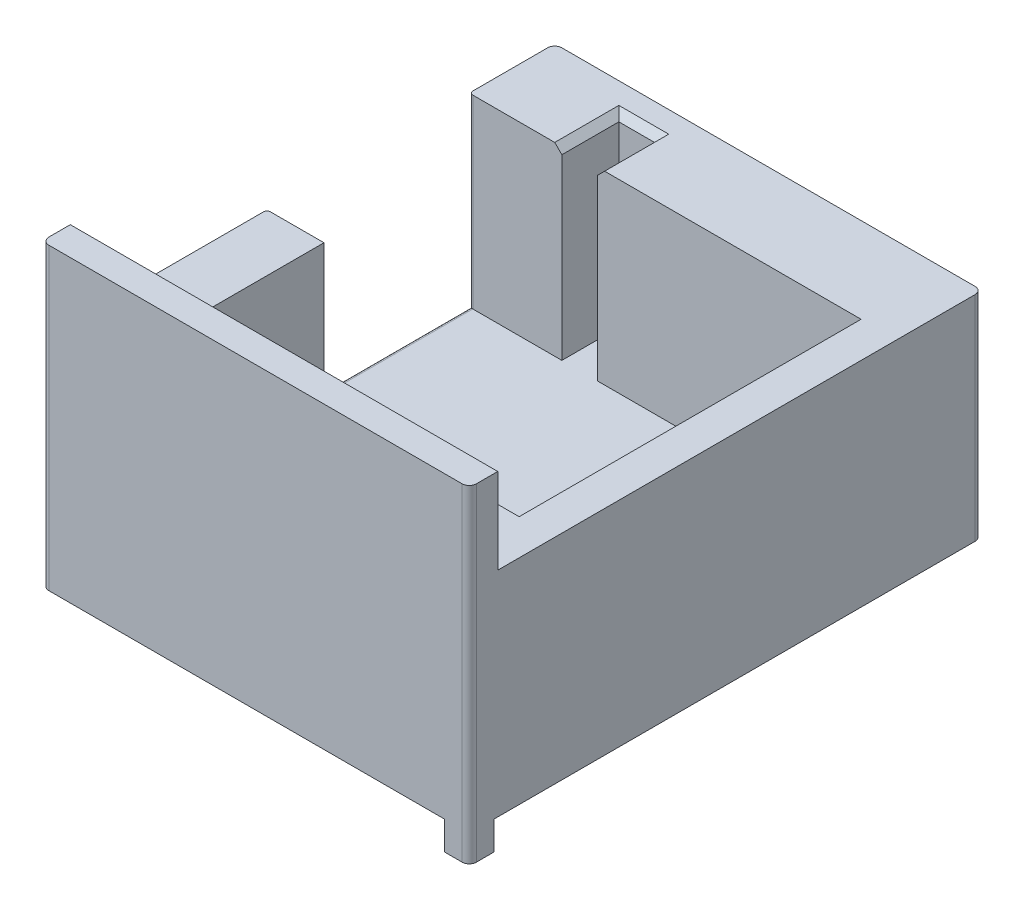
ISO-10303-21;
HEADER;
FILE_DESCRIPTION(('STEP AP214'),'2;1');
FILE_NAME('part.step','',(''),(''),'','','');
FILE_SCHEMA(('AUTOMOTIVE_DESIGN { 1 0 10303 214 1 1 1 1 }'));
ENDSEC;
DATA;
#1=APPLICATION_CONTEXT('core data for automotive mechanical design processes');
#2=APPLICATION_PROTOCOL_DEFINITION('international standard','automotive_design',2000,#1);
#3=PRODUCT_CONTEXT('',#1,'mechanical');
#4=PRODUCT('Part','Part','',(#3));
#5=PRODUCT_RELATED_PRODUCT_CATEGORY('part','',(#4));
#6=PRODUCT_DEFINITION_FORMATION('','',#4);
#7=PRODUCT_DEFINITION_CONTEXT('part definition',#1,'design');
#8=PRODUCT_DEFINITION('design','',#6,#7);
#9=PRODUCT_DEFINITION_SHAPE('','',#8);
#10=(LENGTH_UNIT() NAMED_UNIT(*) SI_UNIT(.MILLI.,.METRE.));
#11=(NAMED_UNIT(*) PLANE_ANGLE_UNIT() SI_UNIT($,.RADIAN.));
#12=(NAMED_UNIT(*) SI_UNIT($,.STERADIAN.) SOLID_ANGLE_UNIT());
#13=UNCERTAINTY_MEASURE_WITH_UNIT(LENGTH_MEASURE(1.E-05),#10,'distance_accuracy_value','');
#14=(GEOMETRIC_REPRESENTATION_CONTEXT(3) GLOBAL_UNCERTAINTY_ASSIGNED_CONTEXT((#13)) GLOBAL_UNIT_ASSIGNED_CONTEXT((#10,
#11,#12)) REPRESENTATION_CONTEXT('',''));
#15=CARTESIAN_POINT('',(0.,0.,0.));
#16=DIRECTION('',(0.,0.,1.));
#17=DIRECTION('',(1.,0.,0.));
#18=AXIS2_PLACEMENT_3D('',#15,#16,#17);
#19=CARTESIAN_POINT('',(0.,15.,0.));
#20=DIRECTION('',(0.,-1.,0.));
#21=DIRECTION('',(0.,0.,-1.));
#22=AXIS2_PLACEMENT_3D('',#19,#20,#21);
#23=PLANE('',#22);
#24=DIRECTION('',(-1.,0.,0.));
#25=VECTOR('',#24,1.);
#26=CARTESIAN_POINT('',(15.001,15.,2.19615242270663));
#27=LINE('',#26,#25);
#28=CARTESIAN_POINT('',(-11.,15.,2.19615242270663));
#29=VERTEX_POINT('',#28);
#30=CARTESIAN_POINT('',(-14.75,15.,2.19615242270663));
#31=VERTEX_POINT('',#30);
#32=EDGE_CURVE('E306',#29,#31,#27,.T.);
#33=ORIENTED_EDGE('',*,*,#32,.T.);
#34=CARTESIAN_POINT('',(-14.75,15.,2.44615242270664));
#35=DIRECTION('',(0.,-1.,0.));
#36=DIRECTION('',(0.,0.,-1.));
#37=AXIS2_PLACEMENT_3D('',#34,#35,#36);
#38=CIRCLE('',#37,0.25);
#39=CARTESIAN_POINT('',(-15.,15.,2.44615242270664));
#40=VERTEX_POINT('',#39);
#41=EDGE_CURVE('E834',#31,#40,#38,.F.);
#42=ORIENTED_EDGE('',*,*,#41,.T.);
#43=DIRECTION('',(0.,0.,1.));
#44=VECTOR('',#43,1.);
#45=CARTESIAN_POINT('',(-15.,15.,18.));
#46=LINE('',#45,#44);
#47=CARTESIAN_POINT('',(-15.,15.,16.));
#48=VERTEX_POINT('',#47);
#49=EDGE_CURVE('E527',#40,#48,#46,.T.);
#50=ORIENTED_EDGE('',*,*,#49,.T.);
#51=DIRECTION('',(1.,0.,0.));
#52=VECTOR('',#51,1.);
#53=CARTESIAN_POINT('',(-21.3245553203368,15.,16.));
#54=LINE('',#53,#52);
#55=CARTESIAN_POINT('',(-9.,15.,16.));
#56=VERTEX_POINT('',#55);
#57=EDGE_CURVE('E436',#48,#56,#54,.T.);
#58=ORIENTED_EDGE('',*,*,#57,.T.);
#59=DIRECTION('',(0.,0.,-1.));
#60=VECTOR('',#59,1.);
#61=CARTESIAN_POINT('',(-9.,15.,0.));
#62=LINE('',#61,#60);
#63=CARTESIAN_POINT('',(-9.,15.,12.));
#64=VERTEX_POINT('',#63);
#65=EDGE_CURVE('E676',#56,#64,#62,.T.);
#66=ORIENTED_EDGE('',*,*,#65,.T.);
#67=DIRECTION('',(1.,0.,0.));
#68=VECTOR('',#67,1.);
#69=CARTESIAN_POINT('',(-8.5,15.,12.));
#70=LINE('',#69,#68);
#71=CARTESIAN_POINT('',(-11.,15.,12.));
#72=VERTEX_POINT('',#71);
#73=EDGE_CURVE('E358',#72,#64,#70,.T.);
#74=ORIENTED_EDGE('',*,*,#73,.F.);
#75=DIRECTION('',(0.,0.,1.));
#76=VECTOR('',#75,1.);
#77=CARTESIAN_POINT('',(-11.,15.,12.));
#78=LINE('',#77,#76);
#79=EDGE_CURVE('E356',#29,#72,#78,.T.);
#80=ORIENTED_EDGE('',*,*,#79,.F.);
#81=EDGE_LOOP('',(#33,#42,#50,#58,#66,#74,#80));
#82=FACE_BOUND('',#81,.T.);
#83=ADVANCED_FACE('F56',(#82),#23,.F.);
#84=CARTESIAN_POINT('',(-15.,15.,18.));
#85=DIRECTION('',(1.,0.,0.));
#86=DIRECTION('',(0.,0.,-1.));
#87=AXIS2_PLACEMENT_3D('',#84,#85,#86);
#88=PLANE('',#87);
#89=ORIENTED_EDGE('',*,*,#49,.F.);
#90=DIRECTION('',(0.,-1.,0.));
#91=VECTOR('',#90,1.);
#92=CARTESIAN_POINT('',(-15.,2.,2.44615242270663));
#93=LINE('',#92,#91);
#94=CARTESIAN_POINT('',(-15.,1.75,2.44615242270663));
#95=VERTEX_POINT('',#94);
#96=EDGE_CURVE('E835',#40,#95,#93,.T.);
#97=ORIENTED_EDGE('',*,*,#96,.T.);
#98=DIRECTION('',(0.,0.,1.));
#99=VECTOR('',#98,1.);
#100=CARTESIAN_POINT('',(-15.,1.75,-12.));
#101=LINE('',#100,#99);
#102=CARTESIAN_POINT('',(-15.,1.75,-12.25));
#103=VERTEX_POINT('',#102);
#104=EDGE_CURVE('E522',#95,#103,#101,.F.);
#105=ORIENTED_EDGE('',*,*,#104,.T.);
#106=DIRECTION('',(0.,1.,0.));
#107=VECTOR('',#106,1.);
#108=CARTESIAN_POINT('',(-15.,15.,-12.25));
#109=LINE('',#108,#107);
#110=CARTESIAN_POINT('',(-15.,15.,-12.25));
#111=VERTEX_POINT('',#110);
#112=EDGE_CURVE('E515',#103,#111,#109,.T.);
#113=ORIENTED_EDGE('',*,*,#112,.T.);
#114=CARTESIAN_POINT('',(-15.,15.,-17.5));
#115=VERTEX_POINT('',#114);
#116=EDGE_CURVE('E429',#115,#111,#46,.T.);
#117=ORIENTED_EDGE('',*,*,#116,.F.);
#118=DIRECTION('',(0.,-1.,0.));
#119=VECTOR('',#118,1.);
#120=CARTESIAN_POINT('',(-15.,15.,-17.5));
#121=LINE('',#120,#119);
#122=CARTESIAN_POINT('',(-15.,0.,-17.5));
#123=VERTEX_POINT('',#122);
#124=EDGE_CURVE('E555',#115,#123,#121,.T.);
#125=ORIENTED_EDGE('',*,*,#124,.T.);
#126=DIRECTION('',(0.,0.,1.));
#127=VECTOR('',#126,1.);
#128=CARTESIAN_POINT('',(-15.,0.,18.));
#129=LINE('',#128,#127);
#130=CARTESIAN_POINT('',(-15.,0.,17.5));
#131=VERTEX_POINT('',#130);
#132=EDGE_CURVE('E538',#123,#131,#129,.T.);
#133=ORIENTED_EDGE('',*,*,#132,.T.);
#134=DIRECTION('',(0.,-1.,0.));
#135=VECTOR('',#134,1.);
#136=CARTESIAN_POINT('',(-15.,15.,17.5));
#137=LINE('',#136,#135);
#138=CARTESIAN_POINT('',(-15.,21.,17.5));
#139=VERTEX_POINT('',#138);
#140=EDGE_CURVE('E558',#131,#139,#137,.F.);
#141=ORIENTED_EDGE('',*,*,#140,.T.);
#142=DIRECTION('',(0.,0.,-1.));
#143=VECTOR('',#142,1.);
#144=CARTESIAN_POINT('',(-15.,21.,18.));
#145=LINE('',#144,#143);
#146=CARTESIAN_POINT('',(-15.,21.,16.));
#147=VERTEX_POINT('',#146);
#148=EDGE_CURVE('E418',#139,#147,#145,.T.);
#149=ORIENTED_EDGE('',*,*,#148,.T.);
#150=DIRECTION('',(0.,-1.,0.));
#151=VECTOR('',#150,1.);
#152=CARTESIAN_POINT('',(-15.,15.,16.));
#153=LINE('',#152,#151);
#154=EDGE_CURVE('E415',#147,#48,#153,.T.);
#155=ORIENTED_EDGE('',*,*,#154,.T.);
#156=EDGE_LOOP('',(#89,#97,#105,#113,#117,#125,#133,#141,#149,#155));
#157=FACE_BOUND('',#156,.T.);
#158=ADVANCED_FACE('F736',(#157),#88,.F.);
#159=ORIENTED_EDGE('',*,*,#116,.T.);
#160=CARTESIAN_POINT('',(-14.75,15.,-12.25));
#161=DIRECTION('',(0.,-1.,0.));
#162=DIRECTION('',(0.,0.,-1.));
#163=AXIS2_PLACEMENT_3D('',#160,#161,#162);
#164=CIRCLE('',#163,0.25);
#165=CARTESIAN_POINT('',(-14.75,15.,-12.));
#166=VERTEX_POINT('',#165);
#167=EDGE_CURVE('E65',#111,#166,#164,.F.);
#168=ORIENTED_EDGE('',*,*,#167,.T.);
#169=DIRECTION('',(-1.,0.,0.));
#170=VECTOR('',#169,1.);
#171=CARTESIAN_POINT('',(-8.5,15.,-12.));
#172=LINE('',#171,#170);
#173=CARTESIAN_POINT('',(-9.,15.,-12.));
#174=VERTEX_POINT('',#173);
#175=EDGE_CURVE('E354',#174,#166,#172,.T.);
#176=ORIENTED_EDGE('',*,*,#175,.F.);
#177=DIRECTION('',(0.,0.,-1.));
#178=VECTOR('',#177,1.);
#179=CARTESIAN_POINT('',(-9.,15.,0.));
#180=LINE('',#179,#178);
#181=CARTESIAN_POINT('',(-9.,15.,-16.5));
#182=VERTEX_POINT('',#181);
#183=EDGE_CURVE('E690',#174,#182,#180,.T.);
#184=ORIENTED_EDGE('',*,*,#183,.T.);
#185=DIRECTION('',(1.,0.,0.));
#186=VECTOR('',#185,1.);
#187=CARTESIAN_POINT('',(0.,15.,-16.5));
#188=LINE('',#187,#186);
#189=CARTESIAN_POINT('',(-5.5,15.,-16.5));
#190=VERTEX_POINT('',#189);
#191=EDGE_CURVE('E691',#182,#190,#188,.T.);
#192=ORIENTED_EDGE('',*,*,#191,.T.);
#193=DIRECTION('',(0.,0.,1.));
#194=VECTOR('',#193,1.);
#195=CARTESIAN_POINT('',(-5.5,15.,0.));
#196=LINE('',#195,#194);
#197=CARTESIAN_POINT('',(-5.49999999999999,15.,-12.));
#198=VERTEX_POINT('',#197);
#199=EDGE_CURVE('E688',#190,#198,#196,.T.);
#200=ORIENTED_EDGE('',*,*,#199,.T.);
#201=DIRECTION('',(-1.,0.,0.));
#202=VECTOR('',#201,1.);
#203=CARTESIAN_POINT('',(12.5,15.,-12.));
#204=LINE('',#203,#202);
#205=CARTESIAN_POINT('',(12.5,15.,-12.));
#206=VERTEX_POINT('',#205);
#207=EDGE_CURVE('E351',#206,#198,#204,.T.);
#208=ORIENTED_EDGE('',*,*,#207,.F.);
#209=DIRECTION('',(0.,0.,-1.));
#210=VECTOR('',#209,1.);
#211=CARTESIAN_POINT('',(12.5,15.,-12.));
#212=LINE('',#211,#210);
#213=CARTESIAN_POINT('',(12.5,15.,12.));
#214=VERTEX_POINT('',#213);
#215=EDGE_CURVE('E348',#214,#206,#212,.T.);
#216=ORIENTED_EDGE('',*,*,#215,.F.);
#217=DIRECTION('',(1.,0.,0.));
#218=VECTOR('',#217,1.);
#219=CARTESIAN_POINT('',(12.5,15.,12.));
#220=LINE('',#219,#218);
#221=CARTESIAN_POINT('',(-5.5,15.,12.));
#222=VERTEX_POINT('',#221);
#223=EDGE_CURVE('E346',#222,#214,#220,.T.);
#224=ORIENTED_EDGE('',*,*,#223,.F.);
#225=DIRECTION('',(0.,0.,1.));
#226=VECTOR('',#225,1.);
#227=CARTESIAN_POINT('',(-5.49999999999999,15.,0.));
#228=LINE('',#227,#226);
#229=CARTESIAN_POINT('',(-5.5,15.,16.));
#230=VERTEX_POINT('',#229);
#231=EDGE_CURVE('E425',#222,#230,#228,.T.);
#232=ORIENTED_EDGE('',*,*,#231,.T.);
#233=CARTESIAN_POINT('',(15.,15.,16.));
#234=VERTEX_POINT('',#233);
#235=EDGE_CURVE('E426',#230,#234,#54,.T.);
#236=ORIENTED_EDGE('',*,*,#235,.T.);
#237=DIRECTION('',(0.,0.,-1.));
#238=VECTOR('',#237,1.);
#239=CARTESIAN_POINT('',(15.,15.,18.));
#240=LINE('',#239,#238);
#241=CARTESIAN_POINT('',(15.,15.,-17.5));
#242=VERTEX_POINT('',#241);
#243=EDGE_CURVE('E393',#234,#242,#240,.T.);
#244=ORIENTED_EDGE('',*,*,#243,.T.);
#245=CARTESIAN_POINT('',(14.5,15.,-17.5));
#246=DIRECTION('',(0.,-1.,0.));
#247=DIRECTION('',(0.,0.,-1.));
#248=AXIS2_PLACEMENT_3D('',#245,#246,#247);
#249=CIRCLE('',#248,0.5);
#250=CARTESIAN_POINT('',(14.5,15.,-18.));
#251=VERTEX_POINT('',#250);
#252=EDGE_CURVE('E576',#242,#251,#249,.F.);
#253=ORIENTED_EDGE('',*,*,#252,.T.);
#254=DIRECTION('',(-1.,0.,0.));
#255=VECTOR('',#254,1.);
#256=CARTESIAN_POINT('',(-15.,15.,-18.));
#257=LINE('',#256,#255);
#258=CARTESIAN_POINT('',(-14.5,15.,-18.));
#259=VERTEX_POINT('',#258);
#260=EDGE_CURVE('E390',#251,#259,#257,.T.);
#261=ORIENTED_EDGE('',*,*,#260,.T.);
#262=CARTESIAN_POINT('',(-14.5,15.,-17.5));
#263=DIRECTION('',(0.,-1.,0.));
#264=DIRECTION('',(0.,0.,-1.));
#265=AXIS2_PLACEMENT_3D('',#262,#263,#264);
#266=CIRCLE('',#265,0.5);
#267=EDGE_CURVE('E578',#259,#115,#266,.F.);
#268=ORIENTED_EDGE('',*,*,#267,.T.);
#269=EDGE_LOOP('',(#159,#168,#176,#184,#192,#200,#208,#216,#224,#232,#236,#244,#253,#261,#268));
#270=FACE_BOUND('',#269,.T.);
#271=ADVANCED_FACE('F696',(#270),#23,.F.);
#272=CARTESIAN_POINT('',(-11.,2.,12.));
#273=DIRECTION('',(-1.,0.,0.));
#274=DIRECTION('',(0.,0.,1.));
#275=AXIS2_PLACEMENT_3D('',#272,#273,#274);
#276=PLANE('',#275);
#277=DIRECTION('',(0.,0.,1.));
#278=VECTOR('',#277,1.);
#279=CARTESIAN_POINT('',(-11.,2.,12.));
#280=LINE('',#279,#278);
#281=CARTESIAN_POINT('',(-11.,2.,2.19615242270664));
#282=VERTEX_POINT('',#281);
#283=CARTESIAN_POINT('',(-11.,2.,12.));
#284=VERTEX_POINT('',#283);
#285=EDGE_CURVE('E317',#282,#284,#280,.T.);
#286=ORIENTED_EDGE('',*,*,#285,.F.);
#287=DIRECTION('',(0.,1.,0.));
#288=VECTOR('',#287,1.);
#289=CARTESIAN_POINT('',(-11.,0.,2.19615242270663));
#290=LINE('',#289,#288);
#291=EDGE_CURVE('E302',#282,#29,#290,.T.);
#292=ORIENTED_EDGE('',*,*,#291,.T.);
#293=ORIENTED_EDGE('',*,*,#79,.T.);
#294=DIRECTION('',(0.,1.,0.));
#295=VECTOR('',#294,1.);
#296=CARTESIAN_POINT('',(-11.,2.,12.));
#297=LINE('',#296,#295);
#298=EDGE_CURVE('E325',#284,#72,#297,.T.);
#299=ORIENTED_EDGE('',*,*,#298,.F.);
#300=EDGE_LOOP('',(#286,#292,#293,#299));
#301=FACE_BOUND('',#300,.T.);
#302=ADVANCED_FACE('F323',(#301),#276,.F.);
#303=CARTESIAN_POINT('',(15.,15.,18.));
#304=DIRECTION('',(-1.,0.,0.));
#305=DIRECTION('',(0.,0.,1.));
#306=AXIS2_PLACEMENT_3D('',#303,#304,#305);
#307=PLANE('',#306);
#308=DIRECTION('',(0.,0.,1.));
#309=VECTOR('',#308,1.);
#310=CARTESIAN_POINT('',(15.,-2.,18.));
#311=LINE('',#310,#309);
#312=CARTESIAN_POINT('',(15.,-2.,16.25));
#313=VERTEX_POINT('',#312);
#314=CARTESIAN_POINT('',(15.,-2.,17.5));
#315=VERTEX_POINT('',#314);
#316=EDGE_CURVE('E440',#313,#315,#311,.T.);
#317=ORIENTED_EDGE('',*,*,#316,.F.);
#318=DIRECTION('',(0.,1.,0.));
#319=VECTOR('',#318,1.);
#320=CARTESIAN_POINT('',(15.,15.,16.25));
#321=LINE('',#320,#319);
#322=CARTESIAN_POINT('',(15.,0.,16.25));
#323=VERTEX_POINT('',#322);
#324=EDGE_CURVE('E465',#313,#323,#321,.T.);
#325=ORIENTED_EDGE('',*,*,#324,.T.);
#326=DIRECTION('',(0.,0.,-1.));
#327=VECTOR('',#326,1.);
#328=CARTESIAN_POINT('',(15.,0.,18.));
#329=LINE('',#328,#327);
#330=CARTESIAN_POINT('',(15.,0.,-17.5));
#331=VERTEX_POINT('',#330);
#332=EDGE_CURVE('E365',#323,#331,#329,.T.);
#333=ORIENTED_EDGE('',*,*,#332,.T.);
#334=DIRECTION('',(0.,-1.,0.));
#335=VECTOR('',#334,1.);
#336=CARTESIAN_POINT('',(15.,15.,-17.5));
#337=LINE('',#336,#335);
#338=EDGE_CURVE('E564',#331,#242,#337,.F.);
#339=ORIENTED_EDGE('',*,*,#338,.T.);
#340=ORIENTED_EDGE('',*,*,#243,.F.);
#341=DIRECTION('',(0.,1.,0.));
#342=VECTOR('',#341,1.);
#343=CARTESIAN_POINT('',(15.,15.,16.));
#344=LINE('',#343,#342);
#345=CARTESIAN_POINT('',(15.,21.,16.));
#346=VERTEX_POINT('',#345);
#347=EDGE_CURVE('E400',#234,#346,#344,.T.);
#348=ORIENTED_EDGE('',*,*,#347,.T.);
#349=DIRECTION('',(0.,0.,1.));
#350=VECTOR('',#349,1.);
#351=CARTESIAN_POINT('',(15.,21.,18.));
#352=LINE('',#351,#350);
#353=CARTESIAN_POINT('',(15.,21.,17.5));
#354=VERTEX_POINT('',#353);
#355=EDGE_CURVE('E403',#346,#354,#352,.T.);
#356=ORIENTED_EDGE('',*,*,#355,.T.);
#357=DIRECTION('',(0.,-1.,0.));
#358=VECTOR('',#357,1.);
#359=CARTESIAN_POINT('',(15.,15.,17.5));
#360=LINE('',#359,#358);
#361=EDGE_CURVE('E566',#354,#315,#360,.T.);
#362=ORIENTED_EDGE('',*,*,#361,.T.);
#363=EDGE_LOOP('',(#317,#325,#333,#339,#340,#348,#356,#362));
#364=FACE_BOUND('',#363,.T.);
#365=ADVANCED_FACE('F623',(#364),#307,.F.);
#366=CARTESIAN_POINT('',(-15.,15.,-18.));
#367=DIRECTION('',(0.,0.,1.));
#368=DIRECTION('',(1.,0.,0.));
#369=AXIS2_PLACEMENT_3D('',#366,#367,#368);
#370=PLANE('',#369);
#371=DIRECTION('',(-1.,0.,0.));
#372=VECTOR('',#371,1.);
#373=CARTESIAN_POINT('',(-15.,0.,-18.));
#374=LINE('',#373,#372);
#375=CARTESIAN_POINT('',(14.5,0.,-18.));
#376=VERTEX_POINT('',#375);
#377=CARTESIAN_POINT('',(-14.5,0.,-18.));
#378=VERTEX_POINT('',#377);
#379=EDGE_CURVE('E533',#376,#378,#374,.T.);
#380=ORIENTED_EDGE('',*,*,#379,.T.);
#381=DIRECTION('',(0.,-1.,0.));
#382=VECTOR('',#381,1.);
#383=CARTESIAN_POINT('',(-14.5,15.,-18.));
#384=LINE('',#383,#382);
#385=EDGE_CURVE('E574',#378,#259,#384,.F.);
#386=ORIENTED_EDGE('',*,*,#385,.T.);
#387=ORIENTED_EDGE('',*,*,#260,.F.);
#388=DIRECTION('',(0.,-1.,0.));
#389=VECTOR('',#388,1.);
#390=CARTESIAN_POINT('',(14.5,15.,-18.));
#391=LINE('',#390,#389);
#392=EDGE_CURVE('E571',#251,#376,#391,.T.);
#393=ORIENTED_EDGE('',*,*,#392,.T.);
#394=EDGE_LOOP('',(#380,#386,#387,#393));
#395=FACE_BOUND('',#394,.T.);
#396=ADVANCED_FACE('F753',(#395),#370,.F.);
#397=CARTESIAN_POINT('',(-15.,15.,18.));
#398=DIRECTION('',(0.,0.,-1.));
#399=DIRECTION('',(-1.,0.,0.));
#400=AXIS2_PLACEMENT_3D('',#397,#398,#399);
#401=PLANE('',#400);
#402=DIRECTION('',(1.,0.,0.));
#403=VECTOR('',#402,1.);
#404=CARTESIAN_POINT('',(-15.,0.,18.));
#405=LINE('',#404,#403);
#406=CARTESIAN_POINT('',(-14.5,0.,18.));
#407=VERTEX_POINT('',#406);
#408=CARTESIAN_POINT('',(13.25,0.,18.));
#409=VERTEX_POINT('',#408);
#410=EDGE_CURVE('E397',#407,#409,#405,.T.);
#411=ORIENTED_EDGE('',*,*,#410,.T.);
#412=DIRECTION('',(0.,-1.,0.));
#413=VECTOR('',#412,1.);
#414=CARTESIAN_POINT('',(13.25,15.,18.));
#415=LINE('',#414,#413);
#416=CARTESIAN_POINT('',(13.25,-2.,18.));
#417=VERTEX_POINT('',#416);
#418=EDGE_CURVE('E587',#409,#417,#415,.T.);
#419=ORIENTED_EDGE('',*,*,#418,.T.);
#420=DIRECTION('',(-1.,0.,0.));
#421=VECTOR('',#420,1.);
#422=CARTESIAN_POINT('',(15.,-2.,18.));
#423=LINE('',#422,#421);
#424=CARTESIAN_POINT('',(14.5,-2.,18.));
#425=VERTEX_POINT('',#424);
#426=EDGE_CURVE('E442',#425,#417,#423,.T.);
#427=ORIENTED_EDGE('',*,*,#426,.F.);
#428=DIRECTION('',(0.,-1.,0.));
#429=VECTOR('',#428,1.);
#430=CARTESIAN_POINT('',(14.5,15.,18.));
#431=LINE('',#430,#429);
#432=CARTESIAN_POINT('',(14.5,21.,18.));
#433=VERTEX_POINT('',#432);
#434=EDGE_CURVE('E543',#425,#433,#431,.F.);
#435=ORIENTED_EDGE('',*,*,#434,.T.);
#436=DIRECTION('',(1.,0.,0.));
#437=VECTOR('',#436,1.);
#438=CARTESIAN_POINT('',(-21.3245553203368,21.,18.));
#439=LINE('',#438,#437);
#440=CARTESIAN_POINT('',(-14.5,21.,18.));
#441=VERTEX_POINT('',#440);
#442=EDGE_CURVE('E419',#441,#433,#439,.T.);
#443=ORIENTED_EDGE('',*,*,#442,.F.);
#444=DIRECTION('',(0.,-1.,0.));
#445=VECTOR('',#444,1.);
#446=CARTESIAN_POINT('',(-14.5,15.,18.));
#447=LINE('',#446,#445);
#448=EDGE_CURVE('E545',#441,#407,#447,.T.);
#449=ORIENTED_EDGE('',*,*,#448,.T.);
#450=EDGE_LOOP('',(#411,#419,#427,#435,#443,#449));
#451=FACE_BOUND('',#450,.T.);
#452=ADVANCED_FACE('F635',(#451),#401,.F.);
#453=CARTESIAN_POINT('',(0.,0.,0.));
#454=DIRECTION('',(0.,-1.,0.));
#455=DIRECTION('',(0.,0.,-1.));
#456=AXIS2_PLACEMENT_3D('',#453,#454,#455);
#457=PLANE('',#456);
#458=DIRECTION('',(0.,0.,1.));
#459=VECTOR('',#458,1.);
#460=CARTESIAN_POINT('',(12.5,0.,0.));
#461=LINE('',#460,#459);
#462=CARTESIAN_POINT('',(12.5,0.,-12.));
#463=VERTEX_POINT('',#462);
#464=CARTESIAN_POINT('',(12.5,0.,12.));
#465=VERTEX_POINT('',#464);
#466=EDGE_CURVE('E483',#463,#465,#461,.T.);
#467=ORIENTED_EDGE('',*,*,#466,.F.);
#468=DIRECTION('',(1.,0.,0.));
#469=VECTOR('',#468,1.);
#470=CARTESIAN_POINT('',(0.,0.,-12.));
#471=LINE('',#470,#469);
#472=CARTESIAN_POINT('',(9.49999999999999,0.,-12.));
#473=VERTEX_POINT('',#472);
#474=EDGE_CURVE('E475',#473,#463,#471,.T.);
#475=ORIENTED_EDGE('',*,*,#474,.F.);
#476=DIRECTION('',(0.,0.,-1.));
#477=VECTOR('',#476,1.);
#478=CARTESIAN_POINT('',(9.5,0.,0.));
#479=LINE('',#478,#477);
#480=CARTESIAN_POINT('',(9.5,0.,12.));
#481=VERTEX_POINT('',#480);
#482=EDGE_CURVE('E478',#481,#473,#479,.T.);
#483=ORIENTED_EDGE('',*,*,#482,.F.);
#484=DIRECTION('',(-1.,0.,0.));
#485=VECTOR('',#484,1.);
#486=CARTESIAN_POINT('',(0.,0.,12.));
#487=LINE('',#486,#485);
#488=EDGE_CURVE('E481',#465,#481,#487,.T.);
#489=ORIENTED_EDGE('',*,*,#488,.F.);
#490=EDGE_LOOP('',(#467,#475,#483,#489));
#491=FACE_BOUND('',#490,.T.);
#492=ORIENTED_EDGE('',*,*,#410,.F.);
#493=CARTESIAN_POINT('',(-14.5,0.,17.5));
#494=DIRECTION('',(0.,-1.,0.));
#495=DIRECTION('',(0.,0.,-1.));
#496=AXIS2_PLACEMENT_3D('',#493,#494,#495);
#497=CIRCLE('',#496,0.5);
#498=EDGE_CURVE('E553',#407,#131,#497,.T.);
#499=ORIENTED_EDGE('',*,*,#498,.T.);
#500=ORIENTED_EDGE('',*,*,#132,.F.);
#501=CARTESIAN_POINT('',(-14.5,0.,-17.5));
#502=DIRECTION('',(0.,-1.,0.));
#503=DIRECTION('',(0.,0.,-1.));
#504=AXIS2_PLACEMENT_3D('',#501,#502,#503);
#505=CIRCLE('',#504,0.5);
#506=EDGE_CURVE('E551',#123,#378,#505,.T.);
#507=ORIENTED_EDGE('',*,*,#506,.T.);
#508=ORIENTED_EDGE('',*,*,#379,.F.);
#509=CARTESIAN_POINT('',(14.5,0.,-17.5));
#510=DIRECTION('',(0.,-1.,0.));
#511=DIRECTION('',(0.,0.,-1.));
#512=AXIS2_PLACEMENT_3D('',#509,#510,#511);
#513=CIRCLE('',#512,0.5);
#514=EDGE_CURVE('E549',#376,#331,#513,.T.);
#515=ORIENTED_EDGE('',*,*,#514,.T.);
#516=ORIENTED_EDGE('',*,*,#332,.F.);
#517=DIRECTION('',(0.707106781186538,0.,0.707106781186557));
#518=VECTOR('',#517,1.);
#519=CARTESIAN_POINT('',(15.,0.,16.25));
#520=LINE('',#519,#518);
#521=CARTESIAN_POINT('',(14.75,0.,16.));
#522=VERTEX_POINT('',#521);
#523=EDGE_CURVE('E473',#323,#522,#520,.F.);
#524=ORIENTED_EDGE('',*,*,#523,.T.);
#525=DIRECTION('',(1.,0.,0.));
#526=VECTOR('',#525,1.);
#527=CARTESIAN_POINT('',(15.,0.,16.));
#528=LINE('',#527,#526);
#529=CARTESIAN_POINT('',(13.25,0.,16.));
#530=VERTEX_POINT('',#529);
#531=EDGE_CURVE('E443',#530,#522,#528,.T.);
#532=ORIENTED_EDGE('',*,*,#531,.F.);
#533=DIRECTION('',(0.707106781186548,0.,-0.707106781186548));
#534=VECTOR('',#533,1.);
#535=CARTESIAN_POINT('',(13.25,0.,16.));
#536=LINE('',#535,#534);
#537=CARTESIAN_POINT('',(13.,0.,16.25));
#538=VERTEX_POINT('',#537);
#539=EDGE_CURVE('E471',#530,#538,#536,.F.);
#540=ORIENTED_EDGE('',*,*,#539,.T.);
#541=DIRECTION('',(0.,0.,-1.));
#542=VECTOR('',#541,1.);
#543=CARTESIAN_POINT('',(13.,0.,18.));
#544=LINE('',#543,#542);
#545=CARTESIAN_POINT('',(13.,0.,17.75));
#546=VERTEX_POINT('',#545);
#547=EDGE_CURVE('E457',#546,#538,#544,.T.);
#548=ORIENTED_EDGE('',*,*,#547,.F.);
#549=DIRECTION('',(-0.707106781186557,0.,-0.707106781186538));
#550=VECTOR('',#549,1.);
#551=CARTESIAN_POINT('',(13.,0.,17.75));
#552=LINE('',#551,#550);
#553=EDGE_CURVE('E468',#546,#409,#552,.F.);
#554=ORIENTED_EDGE('',*,*,#553,.T.);
#555=EDGE_LOOP('',(#492,#499,#500,#507,#508,#515,#516,#524,#532,#540,#548,#554));
#556=FACE_BOUND('',#555,.T.);
#557=ADVANCED_FACE('F608',(#491,#556),#457,.T.);
#558=CARTESIAN_POINT('',(12.5,2.,12.));
#559=DIRECTION('',(0.,0.,1.));
#560=DIRECTION('',(1.,0.,0.));
#561=AXIS2_PLACEMENT_3D('',#558,#559,#560);
#562=PLANE('',#561);
#563=DIRECTION('',(0.,1.,0.));
#564=VECTOR('',#563,1.);
#565=CARTESIAN_POINT('',(-6.,2.,12.));
#566=LINE('',#565,#564);
#567=CARTESIAN_POINT('',(-6.,2.,12.));
#568=VERTEX_POINT('',#567);
#569=CARTESIAN_POINT('',(-6.,14.5,12.));
#570=VERTEX_POINT('',#569);
#571=EDGE_CURVE('E362',#568,#570,#566,.T.);
#572=ORIENTED_EDGE('',*,*,#571,.T.);
#573=DIRECTION('',(-0.707106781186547,-0.707106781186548,0.));
#574=VECTOR('',#573,1.);
#575=CARTESIAN_POINT('',(-6.,14.5,12.));
#576=LINE('',#575,#574);
#577=EDGE_CURVE('E669',#570,#222,#576,.F.);
#578=ORIENTED_EDGE('',*,*,#577,.T.);
#579=ORIENTED_EDGE('',*,*,#223,.T.);
#580=DIRECTION('',(0.,1.,0.));
#581=VECTOR('',#580,1.);
#582=CARTESIAN_POINT('',(12.5,2.,12.));
#583=LINE('',#582,#581);
#584=EDGE_CURVE('E345',#465,#214,#583,.T.);
#585=ORIENTED_EDGE('',*,*,#584,.F.);
#586=ORIENTED_EDGE('',*,*,#488,.T.);
#587=DIRECTION('',(0.,1.,0.));
#588=VECTOR('',#587,1.);
#589=CARTESIAN_POINT('',(9.5,-8.,12.));
#590=LINE('',#589,#588);
#591=CARTESIAN_POINT('',(9.5,2.,12.));
#592=VERTEX_POINT('',#591);
#593=EDGE_CURVE('E650',#481,#592,#590,.T.);
#594=ORIENTED_EDGE('',*,*,#593,.T.);
#595=DIRECTION('',(1.,0.,0.));
#596=VECTOR('',#595,1.);
#597=CARTESIAN_POINT('',(12.5,2.,12.));
#598=LINE('',#597,#596);
#599=EDGE_CURVE('E361',#568,#592,#598,.T.);
#600=ORIENTED_EDGE('',*,*,#599,.F.);
#601=EDGE_LOOP('',(#572,#578,#579,#585,#586,#594,#600));
#602=FACE_BOUND('',#601,.T.);
#603=ADVANCED_FACE('F709',(#602),#562,.F.);
#604=CARTESIAN_POINT('',(-6.,2.,12.));
#605=DIRECTION('',(1.,0.,0.));
#606=DIRECTION('',(0.,0.,-1.));
#607=AXIS2_PLACEMENT_3D('',#604,#605,#606);
#608=PLANE('',#607);
#609=DIRECTION('',(0.,1.,0.));
#610=VECTOR('',#609,1.);
#611=CARTESIAN_POINT('',(-6.,2.,16.));
#612=LINE('',#611,#610);
#613=CARTESIAN_POINT('',(-6.,2.,16.));
#614=VERTEX_POINT('',#613);
#615=CARTESIAN_POINT('',(-6.,14.5,16.));
#616=VERTEX_POINT('',#615);
#617=EDGE_CURVE('E366',#614,#616,#612,.T.);
#618=ORIENTED_EDGE('',*,*,#617,.T.);
#619=DIRECTION('',(0.,0.,-1.));
#620=VECTOR('',#619,1.);
#621=CARTESIAN_POINT('',(-6.,14.5,12.));
#622=LINE('',#621,#620);
#623=EDGE_CURVE('E671',#616,#570,#622,.T.);
#624=ORIENTED_EDGE('',*,*,#623,.T.);
#625=ORIENTED_EDGE('',*,*,#571,.F.);
#626=DIRECTION('',(0.,0.,-1.));
#627=VECTOR('',#626,1.);
#628=CARTESIAN_POINT('',(-6.,2.,12.));
#629=LINE('',#628,#627);
#630=EDGE_CURVE('E342',#614,#568,#629,.T.);
#631=ORIENTED_EDGE('',*,*,#630,.F.);
#632=EDGE_LOOP('',(#618,#624,#625,#631));
#633=FACE_BOUND('',#632,.T.);
#634=ADVANCED_FACE('F707',(#633),#608,.F.);
#635=CARTESIAN_POINT('',(-6.,2.,16.));
#636=DIRECTION('',(0.,0.,1.));
#637=DIRECTION('',(1.,0.,0.));
#638=AXIS2_PLACEMENT_3D('',#635,#636,#637);
#639=PLANE('',#638);
#640=DIRECTION('',(0.,1.,0.));
#641=VECTOR('',#640,1.);
#642=CARTESIAN_POINT('',(-8.5,2.,16.));
#643=LINE('',#642,#641);
#644=CARTESIAN_POINT('',(-8.5,2.,16.));
#645=VERTEX_POINT('',#644);
#646=CARTESIAN_POINT('',(-8.5,14.5,16.));
#647=VERTEX_POINT('',#646);
#648=EDGE_CURVE('E370',#645,#647,#643,.T.);
#649=ORIENTED_EDGE('',*,*,#648,.T.);
#650=DIRECTION('',(0.707106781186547,-0.707106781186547,0.));
#651=VECTOR('',#650,1.);
#652=CARTESIAN_POINT('',(-1.,7.,16.));
#653=LINE('',#652,#651);
#654=EDGE_CURVE('E667',#647,#56,#653,.F.);
#655=ORIENTED_EDGE('',*,*,#654,.T.);
#656=ORIENTED_EDGE('',*,*,#57,.F.);
#657=ORIENTED_EDGE('',*,*,#154,.F.);
#658=DIRECTION('',(1.,0.,0.));
#659=VECTOR('',#658,1.);
#660=CARTESIAN_POINT('',(-21.3245553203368,21.,16.));
#661=LINE('',#660,#659);
#662=EDGE_CURVE('E434',#147,#346,#661,.T.);
#663=ORIENTED_EDGE('',*,*,#662,.T.);
#664=ORIENTED_EDGE('',*,*,#347,.F.);
#665=ORIENTED_EDGE('',*,*,#235,.F.);
#666=DIRECTION('',(0.707106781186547,0.707106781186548,0.));
#667=VECTOR('',#666,1.);
#668=CARTESIAN_POINT('',(-12.25,8.24999999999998,16.));
#669=LINE('',#668,#667);
#670=EDGE_CURVE('E546',#230,#616,#669,.F.);
#671=ORIENTED_EDGE('',*,*,#670,.T.);
#672=ORIENTED_EDGE('',*,*,#617,.F.);
#673=DIRECTION('',(1.,0.,0.));
#674=VECTOR('',#673,1.);
#675=CARTESIAN_POINT('',(-6.,2.,16.));
#676=LINE('',#675,#674);
#677=EDGE_CURVE('E339',#645,#614,#676,.T.);
#678=ORIENTED_EDGE('',*,*,#677,.F.);
#679=EDGE_LOOP('',(#649,#655,#656,#657,#663,#664,#665,#671,#672,#678));
#680=FACE_BOUND('',#679,.T.);
#681=ADVANCED_FACE('F702',(#680),#639,.F.);
#682=CARTESIAN_POINT('',(-8.5,2.,16.));
#683=DIRECTION('',(-1.,0.,0.));
#684=DIRECTION('',(0.,0.,1.));
#685=AXIS2_PLACEMENT_3D('',#682,#683,#684);
#686=PLANE('',#685);
#687=DIRECTION('',(0.,1.,0.));
#688=VECTOR('',#687,1.);
#689=CARTESIAN_POINT('',(-8.5,2.,12.));
#690=LINE('',#689,#688);
#691=CARTESIAN_POINT('',(-8.5,2.,12.));
#692=VERTEX_POINT('',#691);
#693=CARTESIAN_POINT('',(-8.5,14.5,12.));
#694=VERTEX_POINT('',#693);
#695=EDGE_CURVE('E367',#692,#694,#690,.T.);
#696=ORIENTED_EDGE('',*,*,#695,.T.);
#697=DIRECTION('',(0.,0.,1.));
#698=VECTOR('',#697,1.);
#699=CARTESIAN_POINT('',(-8.5,14.5,16.));
#700=LINE('',#699,#698);
#701=EDGE_CURVE('E678',#694,#647,#700,.T.);
#702=ORIENTED_EDGE('',*,*,#701,.T.);
#703=ORIENTED_EDGE('',*,*,#648,.F.);
#704=DIRECTION('',(0.,0.,1.));
#705=VECTOR('',#704,1.);
#706=CARTESIAN_POINT('',(-8.5,2.,16.));
#707=LINE('',#706,#705);
#708=EDGE_CURVE('E330',#692,#645,#707,.T.);
#709=ORIENTED_EDGE('',*,*,#708,.F.);
#710=EDGE_LOOP('',(#696,#702,#703,#709));
#711=FACE_BOUND('',#710,.T.);
#712=ADVANCED_FACE('F715',(#711),#686,.F.);
#713=CARTESIAN_POINT('',(-8.5,2.,12.));
#714=DIRECTION('',(0.,0.,1.));
#715=DIRECTION('',(1.,0.,0.));
#716=AXIS2_PLACEMENT_3D('',#713,#714,#715);
#717=PLANE('',#716);
#718=ORIENTED_EDGE('',*,*,#73,.T.);
#719=DIRECTION('',(-0.707106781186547,0.707106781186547,0.));
#720=VECTOR('',#719,1.);
#721=CARTESIAN_POINT('',(-8.5,14.5,12.));
#722=LINE('',#721,#720);
#723=EDGE_CURVE('E674',#64,#694,#722,.F.);
#724=ORIENTED_EDGE('',*,*,#723,.T.);
#725=ORIENTED_EDGE('',*,*,#695,.F.);
#726=DIRECTION('',(1.,0.,0.));
#727=VECTOR('',#726,1.);
#728=CARTESIAN_POINT('',(-8.5,2.,12.));
#729=LINE('',#728,#727);
#730=EDGE_CURVE('E327',#284,#692,#729,.T.);
#731=ORIENTED_EDGE('',*,*,#730,.F.);
#732=ORIENTED_EDGE('',*,*,#298,.T.);
#733=EDGE_LOOP('',(#718,#724,#725,#731,#732));
#734=FACE_BOUND('',#733,.T.);
#735=ADVANCED_FACE('F724',(#734),#717,.F.);
#736=CARTESIAN_POINT('',(-8.5,2.,-12.));
#737=DIRECTION('',(0.,0.,-1.));
#738=DIRECTION('',(-1.,0.,0.));
#739=AXIS2_PLACEMENT_3D('',#736,#737,#738);
#740=PLANE('',#739);
#741=ORIENTED_EDGE('',*,*,#175,.T.);
#742=DIRECTION('',(0.,1.,0.));
#743=VECTOR('',#742,1.);
#744=CARTESIAN_POINT('',(-14.75,2.,-12.));
#745=LINE('',#744,#743);
#746=CARTESIAN_POINT('',(-14.75,2.,-12.));
#747=VERTEX_POINT('',#746);
#748=EDGE_CURVE('E12',#166,#747,#745,.F.);
#749=ORIENTED_EDGE('',*,*,#748,.T.);
#750=DIRECTION('',(-1.,0.,0.));
#751=VECTOR('',#750,1.);
#752=CARTESIAN_POINT('',(-8.5,2.,-12.));
#753=LINE('',#752,#751);
#754=CARTESIAN_POINT('',(-8.5,2.,-12.));
#755=VERTEX_POINT('',#754);
#756=EDGE_CURVE('E328',#755,#747,#753,.T.);
#757=ORIENTED_EDGE('',*,*,#756,.F.);
#758=DIRECTION('',(0.,1.,0.));
#759=VECTOR('',#758,1.);
#760=CARTESIAN_POINT('',(-8.5,2.,-12.));
#761=LINE('',#760,#759);
#762=CARTESIAN_POINT('',(-8.5,14.5,-12.));
#763=VERTEX_POINT('',#762);
#764=EDGE_CURVE('E372',#755,#763,#761,.T.);
#765=ORIENTED_EDGE('',*,*,#764,.T.);
#766=DIRECTION('',(0.707106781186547,-0.707106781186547,0.));
#767=VECTOR('',#766,1.);
#768=CARTESIAN_POINT('',(-8.5,14.5,-12.));
#769=LINE('',#768,#767);
#770=EDGE_CURVE('E683',#763,#174,#769,.F.);
#771=ORIENTED_EDGE('',*,*,#770,.T.);
#772=EDGE_LOOP('',(#741,#749,#757,#765,#771));
#773=FACE_BOUND('',#772,.T.);
#774=ADVANCED_FACE('F510',(#773),#740,.F.);
#775=CARTESIAN_POINT('',(-8.5,2.,-16.));
#776=DIRECTION('',(-1.,0.,0.));
#777=DIRECTION('',(0.,0.,1.));
#778=AXIS2_PLACEMENT_3D('',#775,#776,#777);
#779=PLANE('',#778);
#780=DIRECTION('',(0.,1.,0.));
#781=VECTOR('',#780,1.);
#782=CARTESIAN_POINT('',(-8.5,2.,-16.));
#783=LINE('',#782,#781);
#784=CARTESIAN_POINT('',(-8.5,2.,-16.));
#785=VERTEX_POINT('',#784);
#786=CARTESIAN_POINT('',(-8.5,14.5,-16.));
#787=VERTEX_POINT('',#786);
#788=EDGE_CURVE('E375',#785,#787,#783,.T.);
#789=ORIENTED_EDGE('',*,*,#788,.T.);
#790=DIRECTION('',(0.,0.,1.));
#791=VECTOR('',#790,1.);
#792=CARTESIAN_POINT('',(-8.5,14.5,-16.));
#793=LINE('',#792,#791);
#794=EDGE_CURVE('E507',#787,#763,#793,.T.);
#795=ORIENTED_EDGE('',*,*,#794,.T.);
#796=ORIENTED_EDGE('',*,*,#764,.F.);
#797=DIRECTION('',(0.,0.,1.));
#798=VECTOR('',#797,1.);
#799=CARTESIAN_POINT('',(-8.5,2.,-16.));
#800=LINE('',#799,#798);
#801=EDGE_CURVE('E332',#785,#755,#800,.T.);
#802=ORIENTED_EDGE('',*,*,#801,.F.);
#803=EDGE_LOOP('',(#789,#795,#796,#802));
#804=FACE_BOUND('',#803,.T.);
#805=ADVANCED_FACE('F505',(#804),#779,.F.);
#806=CARTESIAN_POINT('',(-6.,2.,-16.));
#807=DIRECTION('',(0.,0.,-1.));
#808=DIRECTION('',(-1.,0.,0.));
#809=AXIS2_PLACEMENT_3D('',#806,#807,#808);
#810=PLANE('',#809);
#811=DIRECTION('',(0.,1.,0.));
#812=VECTOR('',#811,1.);
#813=CARTESIAN_POINT('',(-6.,2.,-16.));
#814=LINE('',#813,#812);
#815=CARTESIAN_POINT('',(-6.,2.,-16.));
#816=VERTEX_POINT('',#815);
#817=CARTESIAN_POINT('',(-6.,14.5,-16.));
#818=VERTEX_POINT('',#817);
#819=EDGE_CURVE('E378',#816,#818,#814,.T.);
#820=ORIENTED_EDGE('',*,*,#819,.T.);
#821=DIRECTION('',(-1.,0.,0.));
#822=VECTOR('',#821,1.);
#823=CARTESIAN_POINT('',(-6.,14.5,-16.));
#824=LINE('',#823,#822);
#825=EDGE_CURVE('E681',#818,#787,#824,.T.);
#826=ORIENTED_EDGE('',*,*,#825,.T.);
#827=ORIENTED_EDGE('',*,*,#788,.F.);
#828=DIRECTION('',(-1.,0.,0.));
#829=VECTOR('',#828,1.);
#830=CARTESIAN_POINT('',(-6.,2.,-16.));
#831=LINE('',#830,#829);
#832=EDGE_CURVE('E497',#816,#785,#831,.T.);
#833=ORIENTED_EDGE('',*,*,#832,.F.);
#834=EDGE_LOOP('',(#820,#826,#827,#833));
#835=FACE_BOUND('',#834,.T.);
#836=ADVANCED_FACE('F757',(#835),#810,.F.);
#837=CARTESIAN_POINT('',(-6.,2.,-12.));
#838=DIRECTION('',(1.,0.,0.));
#839=DIRECTION('',(0.,0.,-1.));
#840=AXIS2_PLACEMENT_3D('',#837,#838,#839);
#841=PLANE('',#840);
#842=DIRECTION('',(0.,1.,0.));
#843=VECTOR('',#842,1.);
#844=CARTESIAN_POINT('',(-6.,2.,-12.));
#845=LINE('',#844,#843);
#846=CARTESIAN_POINT('',(-6.,2.,-12.));
#847=VERTEX_POINT('',#846);
#848=CARTESIAN_POINT('',(-6.,14.5,-12.));
#849=VERTEX_POINT('',#848);
#850=EDGE_CURVE('E381',#847,#849,#845,.T.);
#851=ORIENTED_EDGE('',*,*,#850,.T.);
#852=DIRECTION('',(0.,0.,-1.));
#853=VECTOR('',#852,1.);
#854=CARTESIAN_POINT('',(-6.,14.5,-12.));
#855=LINE('',#854,#853);
#856=EDGE_CURVE('E422',#849,#818,#855,.T.);
#857=ORIENTED_EDGE('',*,*,#856,.T.);
#858=ORIENTED_EDGE('',*,*,#819,.F.);
#859=DIRECTION('',(0.,0.,-1.));
#860=VECTOR('',#859,1.);
#861=CARTESIAN_POINT('',(-6.,2.,-12.));
#862=LINE('',#861,#860);
#863=EDGE_CURVE('E495',#847,#816,#862,.T.);
#864=ORIENTED_EDGE('',*,*,#863,.F.);
#865=EDGE_LOOP('',(#851,#857,#858,#864));
#866=FACE_BOUND('',#865,.T.);
#867=ADVANCED_FACE('F760',(#866),#841,.F.);
#868=CARTESIAN_POINT('',(12.5,2.,-12.));
#869=DIRECTION('',(0.,0.,-1.));
#870=DIRECTION('',(-1.,0.,0.));
#871=AXIS2_PLACEMENT_3D('',#868,#869,#870);
#872=PLANE('',#871);
#873=ORIENTED_EDGE('',*,*,#207,.T.);
#874=DIRECTION('',(0.707106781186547,0.707106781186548,0.));
#875=VECTOR('',#874,1.);
#876=CARTESIAN_POINT('',(-6.,14.5,-12.));
#877=LINE('',#876,#875);
#878=EDGE_CURVE('E686',#198,#849,#877,.F.);
#879=ORIENTED_EDGE('',*,*,#878,.T.);
#880=ORIENTED_EDGE('',*,*,#850,.F.);
#881=DIRECTION('',(-1.,0.,0.));
#882=VECTOR('',#881,1.);
#883=CARTESIAN_POINT('',(12.5,2.,-12.));
#884=LINE('',#883,#882);
#885=CARTESIAN_POINT('',(9.5,2.,-12.));
#886=VERTEX_POINT('',#885);
#887=EDGE_CURVE('E489',#886,#847,#884,.T.);
#888=ORIENTED_EDGE('',*,*,#887,.F.);
#889=DIRECTION('',(0.,1.,0.));
#890=VECTOR('',#889,1.);
#891=CARTESIAN_POINT('',(9.49999999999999,-8.,-12.));
#892=LINE('',#891,#890);
#893=EDGE_CURVE('E648',#473,#886,#892,.T.);
#894=ORIENTED_EDGE('',*,*,#893,.F.);
#895=ORIENTED_EDGE('',*,*,#474,.T.);
#896=DIRECTION('',(0.,1.,0.));
#897=VECTOR('',#896,1.);
#898=CARTESIAN_POINT('',(12.5,2.,-12.));
#899=LINE('',#898,#897);
#900=EDGE_CURVE('E384',#463,#206,#899,.T.);
#901=ORIENTED_EDGE('',*,*,#900,.T.);
#902=EDGE_LOOP('',(#873,#879,#880,#888,#894,#895,#901));
#903=FACE_BOUND('',#902,.T.);
#904=ADVANCED_FACE('F764',(#903),#872,.F.);
#905=CARTESIAN_POINT('',(12.5,2.,-12.));
#906=DIRECTION('',(1.,0.,0.));
#907=DIRECTION('',(0.,0.,-1.));
#908=AXIS2_PLACEMENT_3D('',#905,#906,#907);
#909=PLANE('',#908);
#910=ORIENTED_EDGE('',*,*,#215,.T.);
#911=ORIENTED_EDGE('',*,*,#900,.F.);
#912=ORIENTED_EDGE('',*,*,#466,.T.);
#913=ORIENTED_EDGE('',*,*,#584,.T.);
#914=EDGE_LOOP('',(#910,#911,#912,#913));
#915=FACE_BOUND('',#914,.T.);
#916=ADVANCED_FACE('F768',(#915),#909,.F.);
#917=CARTESIAN_POINT('',(0.,2.,0.));
#918=DIRECTION('',(0.,1.,0.));
#919=DIRECTION('',(0.,0.,1.));
#920=AXIS2_PLACEMENT_3D('',#917,#918,#919);
#921=PLANE('',#920);
#922=ORIENTED_EDGE('',*,*,#756,.T.);
#923=DIRECTION('',(0.,0.,1.));
#924=VECTOR('',#923,1.);
#925=CARTESIAN_POINT('',(-14.75,2.,2.19615242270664));
#926=LINE('',#925,#924);
#927=CARTESIAN_POINT('',(-14.75,2.,2.19615242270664));
#928=VERTEX_POINT('',#927);
#929=EDGE_CURVE('E320',#747,#928,#926,.T.);
#930=ORIENTED_EDGE('',*,*,#929,.T.);
#931=DIRECTION('',(-1.,0.,0.));
#932=VECTOR('',#931,1.);
#933=CARTESIAN_POINT('',(15.00105,2.,2.19615242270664));
#934=LINE('',#933,#932);
#935=EDGE_CURVE('E305',#282,#928,#934,.T.);
#936=ORIENTED_EDGE('',*,*,#935,.F.);
#937=ORIENTED_EDGE('',*,*,#285,.T.);
#938=ORIENTED_EDGE('',*,*,#730,.T.);
#939=ORIENTED_EDGE('',*,*,#708,.T.);
#940=ORIENTED_EDGE('',*,*,#677,.T.);
#941=ORIENTED_EDGE('',*,*,#630,.T.);
#942=ORIENTED_EDGE('',*,*,#599,.T.);
#943=DIRECTION('',(0.,0.,1.));
#944=VECTOR('',#943,1.);
#945=CARTESIAN_POINT('',(9.49999999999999,2.,-12.));
#946=LINE('',#945,#944);
#947=EDGE_CURVE('E321',#886,#592,#946,.T.);
#948=ORIENTED_EDGE('',*,*,#947,.F.);
#949=ORIENTED_EDGE('',*,*,#887,.T.);
#950=ORIENTED_EDGE('',*,*,#863,.T.);
#951=ORIENTED_EDGE('',*,*,#832,.T.);
#952=ORIENTED_EDGE('',*,*,#801,.T.);
#953=EDGE_LOOP('',(#922,#930,#936,#937,#938,#939,#940,#941,#942,#948,#949,#950,#951,#952));
#954=FACE_BOUND('',#953,.T.);
#955=ADVANCED_FACE('F315',(#954),#921,.T.);
#956=CARTESIAN_POINT('',(15.001,0.,2.19615242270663));
#957=DIRECTION('',(0.,0.,-1.));
#958=DIRECTION('',(0.,1.,0.));
#959=AXIS2_PLACEMENT_3D('',#956,#957,#958);
#960=PLANE('',#959);
#961=ORIENTED_EDGE('',*,*,#935,.T.);
#962=DIRECTION('',(0.,-1.,0.));
#963=VECTOR('',#962,1.);
#964=CARTESIAN_POINT('',(-14.75,15.,2.19615242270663));
#965=LINE('',#964,#963);
#966=EDGE_CURVE('E80',#928,#31,#965,.F.);
#967=ORIENTED_EDGE('',*,*,#966,.T.);
#968=ORIENTED_EDGE('',*,*,#32,.F.);
#969=ORIENTED_EDGE('',*,*,#291,.F.);
#970=EDGE_LOOP('',(#961,#967,#968,#969));
#971=FACE_BOUND('',#970,.T.);
#972=ADVANCED_FACE('F304',(#971),#960,.T.);
#973=CARTESIAN_POINT('',(13.,-2.,18.));
#974=DIRECTION('',(1.,0.,0.));
#975=DIRECTION('',(0.,0.,-1.));
#976=AXIS2_PLACEMENT_3D('',#973,#974,#975);
#977=PLANE('',#976);
#978=DIRECTION('',(0.,0.,-1.));
#979=VECTOR('',#978,1.);
#980=CARTESIAN_POINT('',(13.,-2.,18.));
#981=LINE('',#980,#979);
#982=CARTESIAN_POINT('',(13.,-2.,17.75));
#983=VERTEX_POINT('',#982);
#984=CARTESIAN_POINT('',(13.,-2.,16.25));
#985=VERTEX_POINT('',#984);
#986=EDGE_CURVE('E446',#983,#985,#981,.T.);
#987=ORIENTED_EDGE('',*,*,#986,.F.);
#988=DIRECTION('',(0.,1.,0.));
#989=VECTOR('',#988,1.);
#990=CARTESIAN_POINT('',(13.,-2.,17.75));
#991=LINE('',#990,#989);
#992=EDGE_CURVE('E584',#983,#546,#991,.T.);
#993=ORIENTED_EDGE('',*,*,#992,.T.);
#994=ORIENTED_EDGE('',*,*,#547,.T.);
#995=DIRECTION('',(0.,-1.,0.));
#996=VECTOR('',#995,1.);
#997=CARTESIAN_POINT('',(13.,-2.,16.25));
#998=LINE('',#997,#996);
#999=EDGE_CURVE('E580',#538,#985,#998,.T.);
#1000=ORIENTED_EDGE('',*,*,#999,.T.);
#1001=EDGE_LOOP('',(#987,#993,#994,#1000));
#1002=FACE_BOUND('',#1001,.T.);
#1003=ADVANCED_FACE('F602',(#1002),#977,.F.);
#1004=CARTESIAN_POINT('',(15.,-2.,16.));
#1005=DIRECTION('',(0.,0.,1.));
#1006=DIRECTION('',(1.,0.,0.));
#1007=AXIS2_PLACEMENT_3D('',#1004,#1005,#1006);
#1008=PLANE('',#1007);
#1009=DIRECTION('',(1.,0.,0.));
#1010=VECTOR('',#1009,1.);
#1011=CARTESIAN_POINT('',(15.,-2.,16.));
#1012=LINE('',#1011,#1010);
#1013=CARTESIAN_POINT('',(13.25,-2.,16.));
#1014=VERTEX_POINT('',#1013);
#1015=CARTESIAN_POINT('',(14.75,-2.,16.));
#1016=VERTEX_POINT('',#1015);
#1017=EDGE_CURVE('E310',#1014,#1016,#1012,.T.);
#1018=ORIENTED_EDGE('',*,*,#1017,.F.);
#1019=DIRECTION('',(0.,1.,0.));
#1020=VECTOR('',#1019,1.);
#1021=CARTESIAN_POINT('',(13.25,-2.,16.));
#1022=LINE('',#1021,#1020);
#1023=EDGE_CURVE('E462',#1014,#530,#1022,.T.);
#1024=ORIENTED_EDGE('',*,*,#1023,.T.);
#1025=ORIENTED_EDGE('',*,*,#531,.T.);
#1026=DIRECTION('',(0.,-1.,0.));
#1027=VECTOR('',#1026,1.);
#1028=CARTESIAN_POINT('',(14.75,-2.,16.));
#1029=LINE('',#1028,#1027);
#1030=EDGE_CURVE('E460',#522,#1016,#1029,.T.);
#1031=ORIENTED_EDGE('',*,*,#1030,.T.);
#1032=EDGE_LOOP('',(#1018,#1024,#1025,#1031));
#1033=FACE_BOUND('',#1032,.T.);
#1034=ADVANCED_FACE('F614',(#1033),#1008,.F.);
#1035=CARTESIAN_POINT('',(0.,-2.,0.));
#1036=DIRECTION('',(0.,1.,0.));
#1037=DIRECTION('',(0.,0.,1.));
#1038=AXIS2_PLACEMENT_3D('',#1035,#1036,#1037);
#1039=PLANE('',#1038);
#1040=ORIENTED_EDGE('',*,*,#426,.T.);
#1041=DIRECTION('',(0.707106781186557,0.,0.707106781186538));
#1042=VECTOR('',#1041,1.);
#1043=CARTESIAN_POINT('',(13.,-2.,17.75));
#1044=LINE('',#1043,#1042);
#1045=EDGE_CURVE('E458',#417,#983,#1044,.F.);
#1046=ORIENTED_EDGE('',*,*,#1045,.T.);
#1047=ORIENTED_EDGE('',*,*,#986,.T.);
#1048=DIRECTION('',(-0.707106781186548,0.,0.707106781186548));
#1049=VECTOR('',#1048,1.);
#1050=CARTESIAN_POINT('',(13.25,-2.,16.));
#1051=LINE('',#1050,#1049);
#1052=EDGE_CURVE('E590',#985,#1014,#1051,.F.);
#1053=ORIENTED_EDGE('',*,*,#1052,.T.);
#1054=ORIENTED_EDGE('',*,*,#1017,.T.);
#1055=DIRECTION('',(-0.707106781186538,0.,-0.707106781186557));
#1056=VECTOR('',#1055,1.);
#1057=CARTESIAN_POINT('',(15.,-2.,16.25));
#1058=LINE('',#1057,#1056);
#1059=EDGE_CURVE('E589',#1016,#313,#1058,.F.);
#1060=ORIENTED_EDGE('',*,*,#1059,.T.);
#1061=ORIENTED_EDGE('',*,*,#316,.T.);
#1062=CARTESIAN_POINT('',(14.5,-2.,17.5));
#1063=DIRECTION('',(0.,1.,0.));
#1064=DIRECTION('',(0.,0.,1.));
#1065=AXIS2_PLACEMENT_3D('',#1062,#1063,#1064);
#1066=CIRCLE('',#1065,0.5);
#1067=EDGE_CURVE('E569',#315,#425,#1066,.F.);
#1068=ORIENTED_EDGE('',*,*,#1067,.T.);
#1069=EDGE_LOOP('',(#1040,#1046,#1047,#1053,#1054,#1060,#1061,#1068));
#1070=FACE_BOUND('',#1069,.T.);
#1071=ADVANCED_FACE('F596',(#1070),#1039,.F.);
#1072=CARTESIAN_POINT('',(-21.3245553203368,21.,18.));
#1073=DIRECTION('',(0.,1.,0.));
#1074=DIRECTION('',(0.,0.,1.));
#1075=AXIS2_PLACEMENT_3D('',#1072,#1073,#1074);
#1076=PLANE('',#1075);
#1077=ORIENTED_EDGE('',*,*,#148,.F.);
#1078=CARTESIAN_POINT('',(-14.5,21.,17.5));
#1079=DIRECTION('',(0.,1.,0.));
#1080=DIRECTION('',(0.,0.,1.));
#1081=AXIS2_PLACEMENT_3D('',#1078,#1079,#1080);
#1082=CIRCLE('',#1081,0.5);
#1083=EDGE_CURVE('E562',#139,#441,#1082,.T.);
#1084=ORIENTED_EDGE('',*,*,#1083,.T.);
#1085=ORIENTED_EDGE('',*,*,#442,.T.);
#1086=CARTESIAN_POINT('',(14.5,21.,17.5));
#1087=DIRECTION('',(0.,1.,0.));
#1088=DIRECTION('',(0.,0.,1.));
#1089=AXIS2_PLACEMENT_3D('',#1086,#1087,#1088);
#1090=CIRCLE('',#1089,0.5);
#1091=EDGE_CURVE('E560',#433,#354,#1090,.T.);
#1092=ORIENTED_EDGE('',*,*,#1091,.T.);
#1093=ORIENTED_EDGE('',*,*,#355,.F.);
#1094=ORIENTED_EDGE('',*,*,#662,.F.);
#1095=EDGE_LOOP('',(#1077,#1084,#1085,#1092,#1093,#1094));
#1096=FACE_BOUND('',#1095,.T.);
#1097=ADVANCED_FACE('F639',(#1096),#1076,.T.);
#1098=CARTESIAN_POINT('',(-8.5,14.5,-16.));
#1099=DIRECTION('',(-0.707106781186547,-0.707106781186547,0.));
#1100=DIRECTION('',(0.,0.,1.));
#1101=AXIS2_PLACEMENT_3D('',#1098,#1099,#1100);
#1102=PLANE('',#1101);
#1103=ORIENTED_EDGE('',*,*,#770,.F.);
#1104=ORIENTED_EDGE('',*,*,#794,.F.);
#1105=DIRECTION('',(0.577350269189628,-0.577350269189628,0.577350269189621));
#1106=VECTOR('',#1105,1.);
#1107=CARTESIAN_POINT('',(-8.5,14.5,-16.));
#1108=LINE('',#1107,#1106);
#1109=EDGE_CURVE('E404',#182,#787,#1108,.T.);
#1110=ORIENTED_EDGE('',*,*,#1109,.F.);
#1111=ORIENTED_EDGE('',*,*,#183,.F.);
#1112=EDGE_LOOP('',(#1103,#1104,#1110,#1111));
#1113=FACE_BOUND('',#1112,.T.);
#1114=ADVANCED_FACE('F796',(#1113),#1102,.F.);
#1115=CARTESIAN_POINT('',(-6.,14.5,-16.));
#1116=DIRECTION('',(0.,-0.707106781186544,-0.707106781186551));
#1117=DIRECTION('',(-1.,0.,0.));
#1118=AXIS2_PLACEMENT_3D('',#1115,#1116,#1117);
#1119=PLANE('',#1118);
#1120=ORIENTED_EDGE('',*,*,#1109,.T.);
#1121=ORIENTED_EDGE('',*,*,#825,.F.);
#1122=DIRECTION('',(0.577350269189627,0.577350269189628,-0.577350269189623));
#1123=VECTOR('',#1122,1.);
#1124=CARTESIAN_POINT('',(-7.33333333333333,13.1666666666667,-14.6666666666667));
#1125=LINE('',#1124,#1123);
#1126=EDGE_CURVE('E654',#190,#818,#1125,.F.);
#1127=ORIENTED_EDGE('',*,*,#1126,.F.);
#1128=ORIENTED_EDGE('',*,*,#191,.F.);
#1129=EDGE_LOOP('',(#1120,#1121,#1127,#1128));
#1130=FACE_BOUND('',#1129,.T.);
#1131=ADVANCED_FACE('F793',(#1130),#1119,.F.);
#1132=CARTESIAN_POINT('',(-6.,14.5,-12.));
#1133=DIRECTION('',(0.707106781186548,-0.707106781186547,0.));
#1134=DIRECTION('',(0.,0.,-1.));
#1135=AXIS2_PLACEMENT_3D('',#1132,#1133,#1134);
#1136=PLANE('',#1135);
#1137=ORIENTED_EDGE('',*,*,#878,.F.);
#1138=ORIENTED_EDGE('',*,*,#199,.F.);
#1139=ORIENTED_EDGE('',*,*,#1126,.T.);
#1140=ORIENTED_EDGE('',*,*,#856,.F.);
#1141=EDGE_LOOP('',(#1137,#1138,#1139,#1140));
#1142=FACE_BOUND('',#1141,.T.);
#1143=ADVANCED_FACE('F790',(#1142),#1136,.F.);
#1144=CARTESIAN_POINT('',(-8.5,14.5,16.));
#1145=DIRECTION('',(-0.707106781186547,-0.707106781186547,0.));
#1146=DIRECTION('',(0.,0.,1.));
#1147=AXIS2_PLACEMENT_3D('',#1144,#1145,#1146);
#1148=PLANE('',#1147);
#1149=ORIENTED_EDGE('',*,*,#723,.F.);
#1150=ORIENTED_EDGE('',*,*,#65,.F.);
#1151=ORIENTED_EDGE('',*,*,#654,.F.);
#1152=ORIENTED_EDGE('',*,*,#701,.F.);
#1153=EDGE_LOOP('',(#1149,#1150,#1151,#1152));
#1154=FACE_BOUND('',#1153,.T.);
#1155=ADVANCED_FACE('F719',(#1154),#1148,.F.);
#1156=CARTESIAN_POINT('',(-6.,14.5,12.));
#1157=DIRECTION('',(0.707106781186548,-0.707106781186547,0.));
#1158=DIRECTION('',(0.,0.,-1.));
#1159=AXIS2_PLACEMENT_3D('',#1156,#1157,#1158);
#1160=PLANE('',#1159);
#1161=ORIENTED_EDGE('',*,*,#670,.F.);
#1162=ORIENTED_EDGE('',*,*,#231,.F.);
#1163=ORIENTED_EDGE('',*,*,#577,.F.);
#1164=ORIENTED_EDGE('',*,*,#623,.F.);
#1165=EDGE_LOOP('',(#1161,#1162,#1163,#1164));
#1166=FACE_BOUND('',#1165,.T.);
#1167=ADVANCED_FACE('F705',(#1166),#1160,.F.);
#1168=CARTESIAN_POINT('',(-14.5,15.,17.5));
#1169=DIRECTION('',(0.,-1.,0.));
#1170=DIRECTION('',(0.,0.,-1.));
#1171=AXIS2_PLACEMENT_3D('',#1168,#1169,#1170);
#1172=CYLINDRICAL_SURFACE('',#1171,0.5);
#1173=ORIENTED_EDGE('',*,*,#1083,.F.);
#1174=ORIENTED_EDGE('',*,*,#140,.F.);
#1175=ORIENTED_EDGE('',*,*,#498,.F.);
#1176=ORIENTED_EDGE('',*,*,#448,.F.);
#1177=EDGE_LOOP('',(#1173,#1174,#1175,#1176));
#1178=FACE_BOUND('',#1177,.T.);
#1179=ADVANCED_FACE('F805',(#1178),#1172,.T.);
#1180=CARTESIAN_POINT('',(14.5,15.,17.5));
#1181=DIRECTION('',(0.,-1.,0.));
#1182=DIRECTION('',(0.,0.,-1.));
#1183=AXIS2_PLACEMENT_3D('',#1180,#1181,#1182);
#1184=CYLINDRICAL_SURFACE('',#1183,0.5);
#1185=ORIENTED_EDGE('',*,*,#1091,.F.);
#1186=ORIENTED_EDGE('',*,*,#434,.F.);
#1187=ORIENTED_EDGE('',*,*,#1067,.F.);
#1188=ORIENTED_EDGE('',*,*,#361,.F.);
#1189=EDGE_LOOP('',(#1185,#1186,#1187,#1188));
#1190=FACE_BOUND('',#1189,.T.);
#1191=ADVANCED_FACE('F631',(#1190),#1184,.T.);
#1192=CARTESIAN_POINT('',(-14.5,15.,-17.5));
#1193=DIRECTION('',(0.,-1.,0.));
#1194=DIRECTION('',(0.,0.,-1.));
#1195=AXIS2_PLACEMENT_3D('',#1192,#1193,#1194);
#1196=CYLINDRICAL_SURFACE('',#1195,0.5);
#1197=ORIENTED_EDGE('',*,*,#267,.F.);
#1198=ORIENTED_EDGE('',*,*,#385,.F.);
#1199=ORIENTED_EDGE('',*,*,#506,.F.);
#1200=ORIENTED_EDGE('',*,*,#124,.F.);
#1201=EDGE_LOOP('',(#1197,#1198,#1199,#1200));
#1202=FACE_BOUND('',#1201,.T.);
#1203=ADVANCED_FACE('F811',(#1202),#1196,.T.);
#1204=CARTESIAN_POINT('',(14.5,15.,-17.5));
#1205=DIRECTION('',(0.,-1.,0.));
#1206=DIRECTION('',(0.,0.,-1.));
#1207=AXIS2_PLACEMENT_3D('',#1204,#1205,#1206);
#1208=CYLINDRICAL_SURFACE('',#1207,0.5);
#1209=ORIENTED_EDGE('',*,*,#252,.F.);
#1210=ORIENTED_EDGE('',*,*,#338,.F.);
#1211=ORIENTED_EDGE('',*,*,#514,.F.);
#1212=ORIENTED_EDGE('',*,*,#392,.F.);
#1213=EDGE_LOOP('',(#1209,#1210,#1211,#1212));
#1214=FACE_BOUND('',#1213,.T.);
#1215=ADVANCED_FACE('F814',(#1214),#1208,.T.);
#1216=CARTESIAN_POINT('',(13.,-2.,17.75));
#1217=DIRECTION('',(0.707106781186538,0.,-0.707106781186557));
#1218=DIRECTION('',(0.,1.,0.));
#1219=AXIS2_PLACEMENT_3D('',#1216,#1217,#1218);
#1220=PLANE('',#1219);
#1221=ORIENTED_EDGE('',*,*,#1045,.F.);
#1222=ORIENTED_EDGE('',*,*,#418,.F.);
#1223=ORIENTED_EDGE('',*,*,#553,.F.);
#1224=ORIENTED_EDGE('',*,*,#992,.F.);
#1225=EDGE_LOOP('',(#1221,#1222,#1223,#1224));
#1226=FACE_BOUND('',#1225,.T.);
#1227=ADVANCED_FACE('F605',(#1226),#1220,.F.);
#1228=CARTESIAN_POINT('',(13.25,-2.,16.));
#1229=DIRECTION('',(0.707106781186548,0.,0.707106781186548));
#1230=DIRECTION('',(0.,1.,0.));
#1231=AXIS2_PLACEMENT_3D('',#1228,#1229,#1230);
#1232=PLANE('',#1231);
#1233=ORIENTED_EDGE('',*,*,#1052,.F.);
#1234=ORIENTED_EDGE('',*,*,#999,.F.);
#1235=ORIENTED_EDGE('',*,*,#539,.F.);
#1236=ORIENTED_EDGE('',*,*,#1023,.F.);
#1237=EDGE_LOOP('',(#1233,#1234,#1235,#1236));
#1238=FACE_BOUND('',#1237,.T.);
#1239=ADVANCED_FACE('F611',(#1238),#1232,.F.);
#1240=CARTESIAN_POINT('',(15.,15.,16.25));
#1241=DIRECTION('',(-0.707106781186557,0.,0.707106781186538));
#1242=DIRECTION('',(0.,1.,0.));
#1243=AXIS2_PLACEMENT_3D('',#1240,#1241,#1242);
#1244=PLANE('',#1243);
#1245=ORIENTED_EDGE('',*,*,#1059,.F.);
#1246=ORIENTED_EDGE('',*,*,#1030,.F.);
#1247=ORIENTED_EDGE('',*,*,#523,.F.);
#1248=ORIENTED_EDGE('',*,*,#324,.F.);
#1249=EDGE_LOOP('',(#1245,#1246,#1247,#1248));
#1250=FACE_BOUND('',#1249,.T.);
#1251=ADVANCED_FACE('F620',(#1250),#1244,.F.);
#1252=CARTESIAN_POINT('',(9.49999999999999,-8.,-12.));
#1253=DIRECTION('',(-1.,0.,0.));
#1254=DIRECTION('',(0.,0.,1.));
#1255=AXIS2_PLACEMENT_3D('',#1252,#1253,#1254);
#1256=PLANE('',#1255);
#1257=ORIENTED_EDGE('',*,*,#482,.T.);
#1258=ORIENTED_EDGE('',*,*,#893,.T.);
#1259=ORIENTED_EDGE('',*,*,#947,.T.);
#1260=ORIENTED_EDGE('',*,*,#593,.F.);
#1261=EDGE_LOOP('',(#1257,#1258,#1259,#1260));
#1262=FACE_BOUND('',#1261,.T.);
#1263=ADVANCED_FACE('F824',(#1262),#1256,.F.);
#1264=CARTESIAN_POINT('',(-14.75,15.,-12.25));
#1265=DIRECTION('',(0.,1.,0.));
#1266=DIRECTION('',(0.,0.,1.));
#1267=AXIS2_PLACEMENT_3D('',#1264,#1265,#1266);
#1268=CYLINDRICAL_SURFACE('',#1267,0.25);
#1269=ORIENTED_EDGE('',*,*,#167,.F.);
#1270=ORIENTED_EDGE('',*,*,#112,.F.);
#1271=CARTESIAN_POINT('',(-14.75,1.75,-12.25));
#1272=DIRECTION('',(0.,0.707106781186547,-0.707106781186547));
#1273=DIRECTION('',(0.,-0.707106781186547,-0.707106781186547));
#1274=AXIS2_PLACEMENT_3D('',#1271,#1272,#1273);
#1275=ELLIPSE('',#1274,0.353553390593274,0.25);
#1276=EDGE_CURVE('E60',#747,#103,#1275,.F.);
#1277=ORIENTED_EDGE('',*,*,#1276,.F.);
#1278=ORIENTED_EDGE('',*,*,#748,.F.);
#1279=EDGE_LOOP('',(#1269,#1270,#1277,#1278));
#1280=FACE_BOUND('',#1279,.T.);
#1281=ADVANCED_FACE('F58',(#1280),#1268,.T.);
#1282=CARTESIAN_POINT('',(-14.75,15.,2.44615242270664));
#1283=DIRECTION('',(0.,1.,0.));
#1284=DIRECTION('',(0.,0.,1.));
#1285=AXIS2_PLACEMENT_3D('',#1282,#1283,#1284);
#1286=CYLINDRICAL_SURFACE('',#1285,0.25);
#1287=ORIENTED_EDGE('',*,*,#41,.F.);
#1288=ORIENTED_EDGE('',*,*,#966,.F.);
#1289=CARTESIAN_POINT('',(-14.75,1.75,2.44615242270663));
#1290=DIRECTION('',(0.,-0.707106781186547,-0.707106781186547));
#1291=DIRECTION('',(0.,0.707106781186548,-0.707106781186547));
#1292=AXIS2_PLACEMENT_3D('',#1289,#1290,#1291);
#1293=ELLIPSE('',#1292,0.353553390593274,0.25);
#1294=EDGE_CURVE('E518',#95,#928,#1293,.T.);
#1295=ORIENTED_EDGE('',*,*,#1294,.F.);
#1296=ORIENTED_EDGE('',*,*,#96,.F.);
#1297=EDGE_LOOP('',(#1287,#1288,#1295,#1296));
#1298=FACE_BOUND('',#1297,.T.);
#1299=ADVANCED_FACE('F826',(#1298),#1286,.T.);
#1300=CARTESIAN_POINT('',(-14.75,1.75,0.));
#1301=DIRECTION('',(0.,0.,-1.));
#1302=DIRECTION('',(-1.,0.,0.));
#1303=AXIS2_PLACEMENT_3D('',#1300,#1301,#1302);
#1304=CYLINDRICAL_SURFACE('',#1303,0.25);
#1305=ORIENTED_EDGE('',*,*,#1276,.T.);
#1306=ORIENTED_EDGE('',*,*,#104,.F.);
#1307=ORIENTED_EDGE('',*,*,#1294,.T.);
#1308=ORIENTED_EDGE('',*,*,#929,.F.);
#1309=EDGE_LOOP('',(#1305,#1306,#1307,#1308));
#1310=FACE_BOUND('',#1309,.T.);
#1311=ADVANCED_FACE('F519',(#1310),#1304,.T.);
#1312=CLOSED_SHELL('',(#83,#158,#271,#302,#365,#396,#452,#557,#603,#634,#681,#712,#735,#774,
#805,#836,#867,#904,#916,#955,#972,#1003,#1034,#1071,#1097,#1114,#1131,#1143,#1155,#1167,#1179,
#1191,#1203,#1215,#1227,#1239,#1251,#1263,#1281,#1299,#1311));
#1313=MANIFOLD_SOLID_BREP('B2',#1312);
#1314=ADVANCED_BREP_SHAPE_REPRESENTATION('',(#18,#1313),#14);
#1315=SHAPE_DEFINITION_REPRESENTATION(#9,#1314);
ENDSEC;
END-ISO-10303-21;
